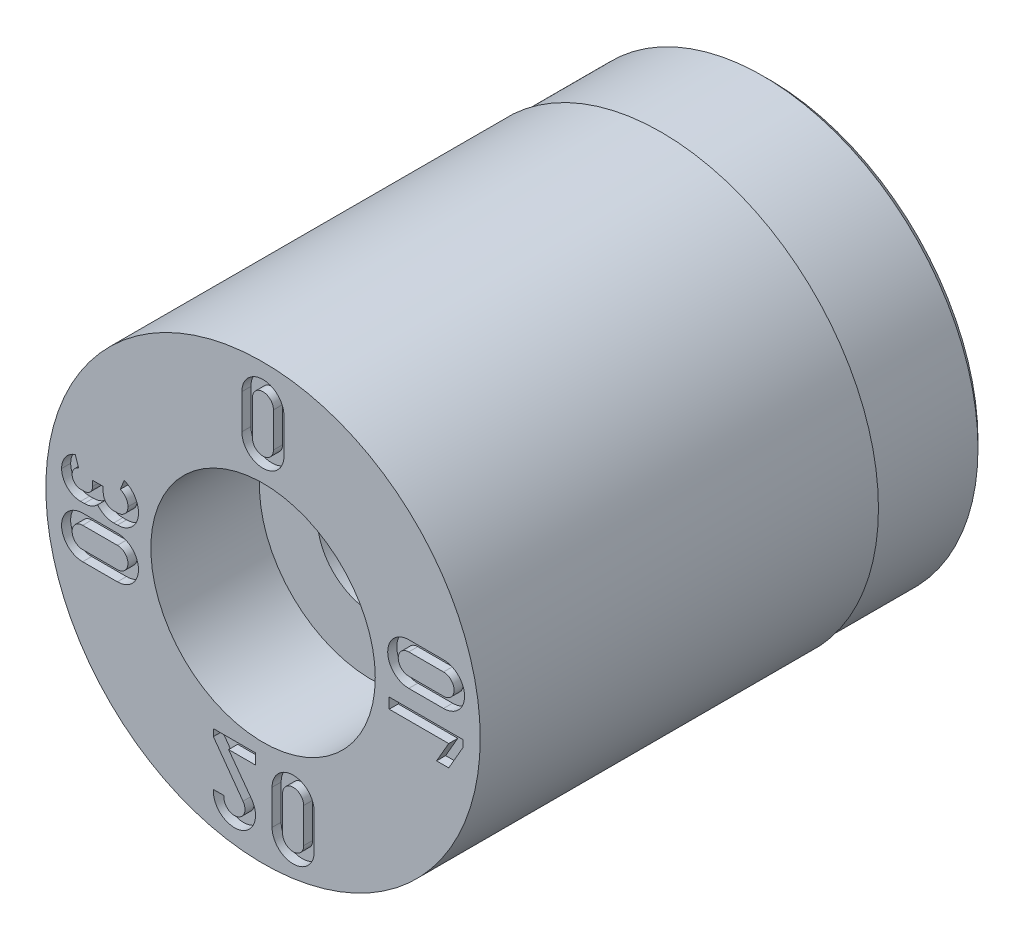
from build123d import *

# Parameters (mm, degrees)
SKETCH4_W          = 3
SKETCH4_H          = 1
CUT_EXTRUDE1_DEPTH = 0.25


with BuildPart() as part:
    # Sketch1 → Revolve1 (revolve)
    with BuildSketch(Plane(origin=(0, 0, 0), x_dir=(0, 0, -1), z_dir=(1, 0, 0)), mode=Mode.PRIVATE) as revolve1_sk:
        Polygon((0, 6), (0, 3.1), (3, 3.1), (3, 1.5), (14, 1.5), (14, 5.75), (13.75, 6), align=None)
    revolve(revolve1_sk.sketch.rotate(Axis((0, 0, 3.797909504), (0, 0, -1)), 90), axis=Axis((0, 0, 3.797909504), (0, 0, -1)))

    # Sketch4 → Cut-Revolve1 (revolve, cut)
    with BuildSketch(Plane(origin=(0, 0, 0), x_dir=(0, 0, -1), z_dir=(1, 0, 0)), mode=Mode.PRIVATE) as cut_revolve1_sk:
        with Locations((12.5, 6.435)):
            Rectangle(SKETCH4_W, SKETCH4_H)
    revolve(cut_revolve1_sk.sketch.rotate(Axis((0, 0, 0), (0, 0, -1)), 90), axis=Axis((0, 0, 0), (0, 0, -1)), mode=Mode.SUBTRACT)

    # Sketch2 → Cut-Extrude1 (cut)
    # profile 1 of 7: a face of its own
    with BuildSketch(Plane.XY):
        with BuildLine():
            Line((1.413744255, -5.008533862), (1.41382618, -4.048399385))
            ThreePointArc((1.41382618, -4.048399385), (0.831713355, -3.466323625), (0.249664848, -4.048463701))
            Line((0.249664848, -4.048463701), (0.249745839, -5.008632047))
            ThreePointArc((0.249745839, -5.008632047), (0.83179414, -5.590582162), (1.413744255, -5.008533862))
        make_face()
        with BuildLine():
            Line((0.540745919, -4.048439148), (0.54082691, -5.008607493))
            ThreePointArc((0.54082691, -5.008607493), (0.831769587, -5.299501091), (1.122663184, -5.008558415))
            Line((1.122663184, -5.008558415), (1.122745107, -4.048369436))
            ThreePointArc((1.122745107, -4.048369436), (0.831710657, -3.757404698), (0.540745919, -4.048439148))
        make_face(mode=Mode.SUBTRACT)
    # profile 2 of 7: a face of its own
    with BuildSketch(Plane.XY):
        with BuildLine():
            Line((-4.022286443, 0.379630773), (-4.124122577, 0.379639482))
            ThreePointArc((-4.124122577, 0.379639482), (-4.329800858, 0.464854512), (-4.414981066, 0.670547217))
            Line((-4.414981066, 0.670547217), (-4.414968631, 0.816000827))
            Line((-4.414968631, 0.816000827), (-4.705968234, 0.816025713))
            Line((-4.705968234, 0.816025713), (-4.705980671, 0.670607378))
            ThreePointArc((-4.705980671, 0.670607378), (-4.774165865, 0.506033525), (-4.938751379, 0.437876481))
            Line((-4.938751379, 0.437876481), (-5.04057342, 0.437885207))
            ThreePointArc((-5.04057342, 0.437885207), (-5.205089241, 0.506128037), (-5.273315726, 0.670650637))
            ThreePointArc((-5.273315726, 0.670650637), (-5.22426204, 0.823356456), (-5.095288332, 0.918703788))
            Line((-5.095288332, 0.918703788), (-5.188382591, 1.194399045))
            ThreePointArc((-5.188382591, 1.194399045), (-5.460533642, 0.993000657), (-5.564280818, 0.670721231))
            ThreePointArc((-5.564280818, 0.670721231), (-5.410943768, 0.300310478), (-5.040569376, 0.146885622))
            Line((-5.040569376, 0.146885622), (-4.938776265, 0.146876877))
            ThreePointArc((-4.938776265, 0.146876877), (-4.739989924, 0.186068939), (-4.570974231, 0.297808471))
            ThreePointArc((-4.570974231, 0.297808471), (-4.370830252, 0.143501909), (-4.124135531, 0.08863989))
            Line((-4.124135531, 0.08863989), (-4.022262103, 0.088631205))
            ThreePointArc((-4.022262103, 0.088631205), (-3.61081057, 0.259035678), (-3.440393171, 0.670481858))
            ThreePointArc((-3.440393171, 0.670481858), (-3.548772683, 1.022420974), (-3.836335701, 1.252453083))
            Line((-3.836335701, 1.252453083), (-3.943114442, 0.981879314))
            ThreePointArc((-3.943114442, 0.981879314), (-3.789275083, 0.85883138), (-3.731311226, 0.670556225))
            ThreePointArc((-3.731311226, 0.670556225), (-3.816546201, 0.464830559), (-4.022286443, 0.379630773))
        make_face()
    # profile 3 of 7: a face of its own
    with BuildSketch(Plane.XY):
        with BuildLine():
            Line((4.985565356, 1.369230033), (4.025420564, 1.369311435))
            ThreePointArc((4.025420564, 1.369311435), (3.44347077, 0.787274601), (4.02549582, 0.205313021))
            Line((4.02549582, 0.205313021), (4.985664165, 0.205394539))
            ThreePointArc((4.985664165, 0.205394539), (5.567532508, 0.78736169), (4.985565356, 1.369230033))
        make_face()
        with BuildLine():
            Line((4.025471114, 0.496312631), (4.98563946, 0.496394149))
            ThreePointArc((4.98563946, 0.496394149), (5.276532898, 0.787336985), (4.985590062, 1.078230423))
            Line((4.985590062, 1.078230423), (4.025401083, 1.078311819))
            ThreePointArc((4.025401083, 1.078311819), (3.734470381, 0.787277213), (4.025471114, 0.496312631))
        make_face(mode=Mode.SUBTRACT)
    # profile 4 of 7: a face of its own
    with BuildSketch(Plane.XY):
        Polygon((5.521905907, -0.271485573), (5.521922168, -0.463014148), (5.130205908, -1.144354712), (4.794643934, -1.144383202), (5.129097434, -0.562437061), (3.485259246, -0.562576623), (3.485234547, -0.271658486), align=None)
    # profile 5 of 7: a face of its own
    with BuildSketch(Plane.XY):
        with BuildLine():
            Line((-0.208267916, -3.746050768), (-0.208292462, -3.455047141))
            Line((-0.208292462, -3.455047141), (-1.372129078, -3.455145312))
            Line((-1.372129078, -3.455145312), (-1.372112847, -3.647570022))
            Line((-1.372112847, -3.647570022), (-0.553845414, -4.783393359))
            ThreePointArc((-0.553845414, -4.783393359), (-0.721682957, -5.23641511), (-1.077723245, -4.909867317))
            Line((-1.077723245, -4.909867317), (-1.37037703, -4.909898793))
            ThreePointArc((-1.37037703, -4.909898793), (-0.631877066, -5.513505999), (-0.317384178, -4.613051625))
            Line((-0.317384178, -4.613051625), (-0.950268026, -3.746113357))
            Line((-0.950268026, -3.746113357), (-0.208267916, -3.746050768))
        make_face()
    # profile 6 of 7: a face of its own
    with BuildSketch(Plane.XY):
        with BuildLine():
            Line((-0.585457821, 4.998687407), (-0.585376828, 4.038542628))
            ThreePointArc((-0.585376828, 4.038542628), (-0.003340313, 3.456592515), (0.578621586, 4.038617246))
            Line((0.578621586, 4.038617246), (0.578703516, 4.998785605))
            ThreePointArc((0.578703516, 4.998785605), (-0.003426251, 5.580817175), (-0.585457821, 4.998687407))
        make_face()
        with BuildLine():
            Line((0.287621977, 4.0385927), (0.287540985, 4.998761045))
            ThreePointArc((0.287540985, 4.998761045), (-0.003401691, 5.289654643), (-0.294295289, 4.998711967))
            Line((-0.294295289, 4.998711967), (-0.294377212, 4.038522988))
            ThreePointArc((-0.294377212, 4.038522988), (-0.003342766, 3.747592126), (0.287621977, 4.0385927))
        make_face(mode=Mode.SUBTRACT)
    # profile 7 of 7: a face of its own
    with BuildSketch(Plane.XY):
        with BuildLine():
            Line((-4.983135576, -0.105603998), (-4.022990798, -0.105686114))
            ThreePointArc((-4.022990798, -0.105686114), (-3.44102369, -0.687720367), (-4.023060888, -1.26968453))
            Line((-4.023060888, -1.26968453), (-4.983235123, -1.269602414))
            ThreePointArc((-4.983235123, -1.269602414), (-5.565184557, -0.687553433), (-4.983135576, -0.105603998))
        make_face()
        with BuildLine():
            Line((-4.023074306, -0.978766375), (-4.983210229, -0.978521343))
            ThreePointArc((-4.983210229, -0.978521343), (-5.274103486, -0.687578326), (-4.98316047, -0.396685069))
            Line((-4.98316047, -0.396685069), (-4.022971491, -0.39660427))
            ThreePointArc((-4.022971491, -0.39660427), (-3.731941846, -0.687736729), (-4.023074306, -0.978766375))
        make_face(mode=Mode.SUBTRACT)
    extrude(amount=-CUT_EXTRUDE1_DEPTH, mode=Mode.SUBTRACT)


solid = part.part
